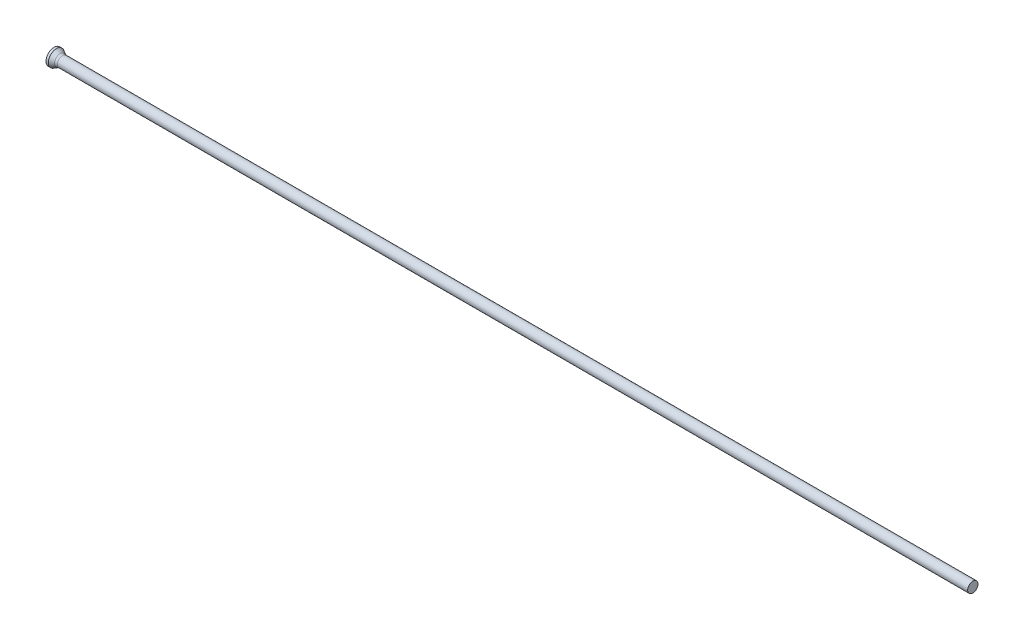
ISO-10303-21;
HEADER;
FILE_DESCRIPTION(('STEP AP214'),'2;1');
FILE_NAME('part.step','',(''),(''),'','','');
FILE_SCHEMA(('AUTOMOTIVE_DESIGN { 1 0 10303 214 1 1 1 1 }'));
ENDSEC;
DATA;
#1=APPLICATION_CONTEXT('core data for automotive mechanical design processes');
#2=APPLICATION_PROTOCOL_DEFINITION('international standard','automotive_design',2000,#1);
#3=PRODUCT_CONTEXT('',#1,'mechanical');
#4=PRODUCT('Part','Part','',(#3));
#5=PRODUCT_RELATED_PRODUCT_CATEGORY('part','',(#4));
#6=PRODUCT_DEFINITION_FORMATION('','',#4);
#7=PRODUCT_DEFINITION_CONTEXT('part definition',#1,'design');
#8=PRODUCT_DEFINITION('design','',#6,#7);
#9=PRODUCT_DEFINITION_SHAPE('','',#8);
#10=(LENGTH_UNIT() NAMED_UNIT(*) SI_UNIT(.MILLI.,.METRE.));
#11=(NAMED_UNIT(*) PLANE_ANGLE_UNIT() SI_UNIT($,.RADIAN.));
#12=(NAMED_UNIT(*) SI_UNIT($,.STERADIAN.) SOLID_ANGLE_UNIT());
#13=UNCERTAINTY_MEASURE_WITH_UNIT(LENGTH_MEASURE(1.E-05),#10,'distance_accuracy_value','');
#14=(GEOMETRIC_REPRESENTATION_CONTEXT(3) GLOBAL_UNCERTAINTY_ASSIGNED_CONTEXT((#13)) GLOBAL_UNIT_ASSIGNED_CONTEXT((#10,
#11,#12)) REPRESENTATION_CONTEXT('',''));
#15=CARTESIAN_POINT('',(0.,0.,0.));
#16=DIRECTION('',(0.,0.,1.));
#17=DIRECTION('',(1.,0.,0.));
#18=AXIS2_PLACEMENT_3D('',#15,#16,#17);
#19=CARTESIAN_POINT('',(0.,0.,0.));
#20=DIRECTION('',(1.,0.,0.));
#21=DIRECTION('',(0.,0.,-1.));
#22=AXIS2_PLACEMENT_3D('',#19,#20,#21);
#23=PLANE('',#22);
#24=CARTESIAN_POINT('',(0.,0.,0.));
#25=DIRECTION('',(-1.,0.,0.));
#26=DIRECTION('',(0.,0.,1.));
#27=AXIS2_PLACEMENT_3D('',#24,#25,#26);
#28=CIRCLE('',#27,1.75);
#29=CARTESIAN_POINT('',(0.,0.,1.75));
#30=VERTEX_POINT('',#29);
#31=EDGE_CURVE('E25',#30,#30,#28,.T.);
#32=ORIENTED_EDGE('',*,*,#31,.T.);
#33=EDGE_LOOP('',(#32));
#34=FACE_BOUND('',#33,.T.);
#35=ADVANCED_FACE('F14',(#34),#23,.F.);
#36=CARTESIAN_POINT('',(0.,0.,0.));
#37=DIRECTION('',(-1.,0.,0.));
#38=DIRECTION('',(0.,0.,1.));
#39=AXIS2_PLACEMENT_3D('',#36,#37,#38);
#40=CYLINDRICAL_SURFACE('',#39,1.75);
#41=ORIENTED_EDGE('',*,*,#31,.F.);
#42=EDGE_LOOP('',(#41));
#43=FACE_BOUND('',#42,.T.);
#44=CARTESIAN_POINT('',(0.507468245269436,0.,0.));
#45=DIRECTION('',(-1.,0.,0.));
#46=DIRECTION('',(0.,0.,1.));
#47=AXIS2_PLACEMENT_3D('',#44,#45,#46);
#48=CIRCLE('',#47,1.75);
#49=CARTESIAN_POINT('',(0.507468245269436,0.,1.75));
#50=VERTEX_POINT('',#49);
#51=EDGE_CURVE('E29',#50,#50,#48,.T.);
#52=ORIENTED_EDGE('',*,*,#51,.T.);
#53=EDGE_LOOP('',(#52));
#54=FACE_BOUND('',#53,.T.);
#55=ADVANCED_FACE('F53',(#43,#54),#40,.T.);
#56=CARTESIAN_POINT('',(1.59,0.,0.));
#57=DIRECTION('',(-1.,0.,0.));
#58=DIRECTION('',(0.,0.,1.));
#59=AXIS2_PLACEMENT_3D('',#56,#57,#58);
#60=CONICAL_SURFACE('',#59,1.125,0.523598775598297);
#61=CARTESIAN_POINT('',(1.35794919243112,0.,0.));
#62=DIRECTION('',(-1.,0.,0.));
#63=DIRECTION('',(0.,0.,1.));
#64=AXIS2_PLACEMENT_3D('',#61,#62,#63);
#65=CIRCLE('',#64,1.25897459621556);
#66=CARTESIAN_POINT('',(1.35794919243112,0.,1.25897459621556));
#67=VERTEX_POINT('',#66);
#68=EDGE_CURVE('E21',#67,#67,#65,.T.);
#69=ORIENTED_EDGE('',*,*,#68,.T.);
#70=EDGE_LOOP('',(#69));
#71=FACE_BOUND('',#70,.T.);
#72=ORIENTED_EDGE('',*,*,#51,.F.);
#73=EDGE_LOOP('',(#72));
#74=FACE_BOUND('',#73,.T.);
#75=ADVANCED_FACE('F50',(#71,#74),#60,.T.);
#76=CARTESIAN_POINT('',(0.,0.,0.));
#77=DIRECTION('',(-1.,0.,0.));
#78=DIRECTION('',(0.,0.,1.));
#79=AXIS2_PLACEMENT_3D('',#76,#77,#78);
#80=CYLINDRICAL_SURFACE('',#79,1.125);
#81=CARTESIAN_POINT('',(1.85794919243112,0.,0.));
#82=DIRECTION('',(-1.,0.,0.));
#83=DIRECTION('',(0.,0.,1.));
#84=AXIS2_PLACEMENT_3D('',#81,#82,#83);
#85=CIRCLE('',#84,1.125);
#86=CARTESIAN_POINT('',(1.85794919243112,0.,1.125));
#87=VERTEX_POINT('',#86);
#88=EDGE_CURVE('E9',#87,#87,#85,.F.);
#89=ORIENTED_EDGE('',*,*,#88,.T.);
#90=EDGE_LOOP('',(#89));
#91=FACE_BOUND('',#90,.T.);
#92=CARTESIAN_POINT('',(200.,0.,0.));
#93=DIRECTION('',(-1.,0.,0.));
#94=DIRECTION('',(0.,0.,1.));
#95=AXIS2_PLACEMENT_3D('',#92,#93,#94);
#96=CIRCLE('',#95,1.125);
#97=CARTESIAN_POINT('',(200.,0.,1.125));
#98=VERTEX_POINT('',#97);
#99=EDGE_CURVE('E34',#98,#98,#96,.T.);
#100=ORIENTED_EDGE('',*,*,#99,.T.);
#101=EDGE_LOOP('',(#100));
#102=FACE_BOUND('',#101,.T.);
#103=ADVANCED_FACE('F38',(#91,#102),#80,.T.);
#104=CARTESIAN_POINT('',(200.,1.125,0.));
#105=DIRECTION('',(-1.,0.,0.));
#106=DIRECTION('',(0.,0.,1.));
#107=AXIS2_PLACEMENT_3D('',#104,#105,#106);
#108=PLANE('',#107);
#109=ORIENTED_EDGE('',*,*,#99,.F.);
#110=EDGE_LOOP('',(#109));
#111=FACE_BOUND('',#110,.T.);
#112=ADVANCED_FACE('F40',(#111),#108,.F.);
#113=CARTESIAN_POINT('',(1.85794919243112,0.,0.));
#114=DIRECTION('',(-1.,0.,0.));
#115=DIRECTION('',(0.,0.,1.));
#116=AXIS2_PLACEMENT_3D('',#113,#114,#115);
#117=TOROIDAL_SURFACE('',#116,2.125,1.);
#118=ORIENTED_EDGE('',*,*,#88,.F.);
#119=EDGE_LOOP('',(#118));
#120=FACE_BOUND('',#119,.T.);
#121=ORIENTED_EDGE('',*,*,#68,.F.);
#122=EDGE_LOOP('',(#121));
#123=FACE_BOUND('',#122,.T.);
#124=ADVANCED_FACE('F16',(#120,#123),#117,.F.);
#125=CLOSED_SHELL('',(#35,#55,#75,#103,#112,#124));
#126=MANIFOLD_SOLID_BREP('B1',#125);
#127=ADVANCED_BREP_SHAPE_REPRESENTATION('',(#18,#126),#14);
#128=SHAPE_DEFINITION_REPRESENTATION(#9,#127);
ENDSEC;
END-ISO-10303-21;
